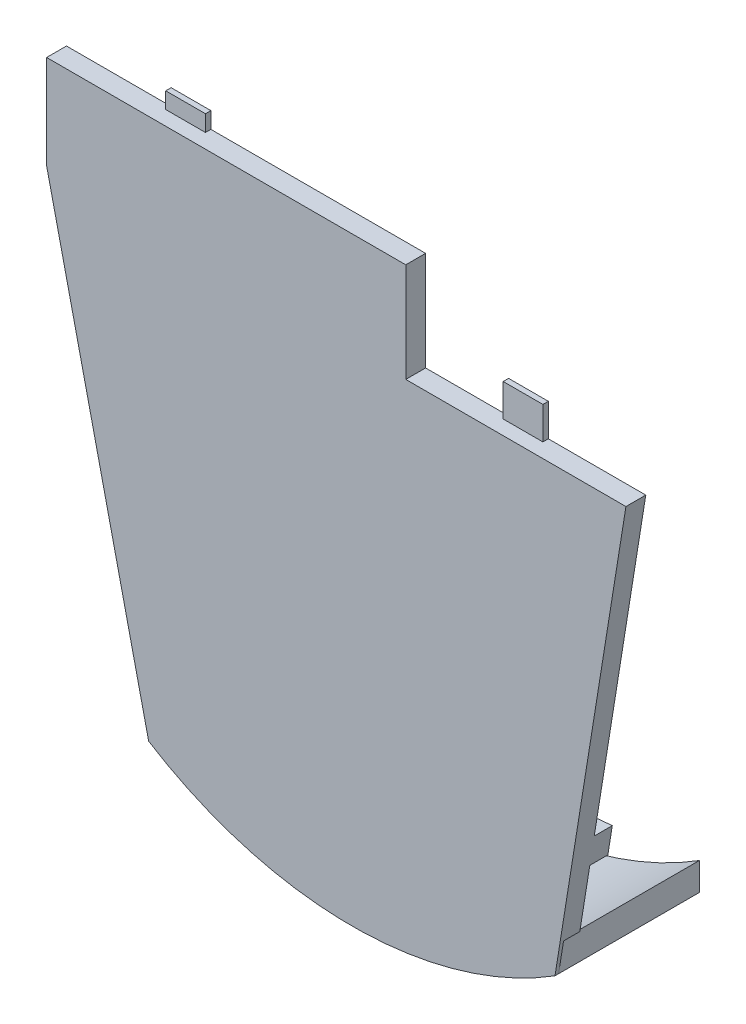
ISO-10303-21;
HEADER;
FILE_DESCRIPTION(('STEP AP214'),'2;1');
FILE_NAME('part.step','',(''),(''),'','','');
FILE_SCHEMA(('AUTOMOTIVE_DESIGN { 1 0 10303 214 1 1 1 1 }'));
ENDSEC;
DATA;
#1=APPLICATION_CONTEXT('core data for automotive mechanical design processes');
#2=APPLICATION_PROTOCOL_DEFINITION('international standard','automotive_design',2000,#1);
#3=PRODUCT_CONTEXT('',#1,'mechanical');
#4=PRODUCT('Part','Part','',(#3));
#5=PRODUCT_RELATED_PRODUCT_CATEGORY('part','',(#4));
#6=PRODUCT_DEFINITION_FORMATION('','',#4);
#7=PRODUCT_DEFINITION_CONTEXT('part definition',#1,'design');
#8=PRODUCT_DEFINITION('design','',#6,#7);
#9=PRODUCT_DEFINITION_SHAPE('','',#8);
#10=(LENGTH_UNIT() NAMED_UNIT(*) SI_UNIT(.MILLI.,.METRE.));
#11=(NAMED_UNIT(*) PLANE_ANGLE_UNIT() SI_UNIT($,.RADIAN.));
#12=(NAMED_UNIT(*) SI_UNIT($,.STERADIAN.) SOLID_ANGLE_UNIT());
#13=UNCERTAINTY_MEASURE_WITH_UNIT(LENGTH_MEASURE(1.E-05),#10,'distance_accuracy_value','');
#14=(GEOMETRIC_REPRESENTATION_CONTEXT(3) GLOBAL_UNCERTAINTY_ASSIGNED_CONTEXT((#13)) GLOBAL_UNIT_ASSIGNED_CONTEXT((#10,
#11,#12)) REPRESENTATION_CONTEXT('',''));
#15=CARTESIAN_POINT('',(0.,0.,0.));
#16=DIRECTION('',(0.,0.,1.));
#17=DIRECTION('',(1.,0.,0.));
#18=AXIS2_PLACEMENT_3D('',#15,#16,#17);
#19=CARTESIAN_POINT('',(-9.44819018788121,51.9759444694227,17.526));
#20=DIRECTION('',(0.,0.,-1.));
#21=DIRECTION('',(-1.,0.,0.));
#22=AXIS2_PLACEMENT_3D('',#19,#20,#21);
#23=PLANE('',#22);
#24=DIRECTION('',(0.167445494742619,0.985881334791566,0.));
#25=VECTOR('',#24,1.);
#26=CARTESIAN_POINT('',(19.4949588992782,19.3151711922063,17.526));
#27=LINE('',#26,#25);
#28=CARTESIAN_POINT('',(18.9420538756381,16.0597910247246,17.526));
#29=VERTEX_POINT('',#28);
#30=CARTESIAN_POINT('',(19.4949588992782,19.3151711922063,17.526));
#31=VERTEX_POINT('',#30);
#32=EDGE_CURVE('E797',#29,#31,#27,.T.);
#33=ORIENTED_EDGE('',*,*,#32,.F.);
#34=DIRECTION('',(-0.987358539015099,0.1585027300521,0.));
#35=VECTOR('',#34,1.);
#36=CARTESIAN_POINT('',(18.9420538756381,16.0597910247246,17.526));
#37=LINE('',#36,#35);
#38=CARTESIAN_POINT('',(21.3998245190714,15.6652399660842,17.526));
#39=VERTEX_POINT('',#38);
#40=EDGE_CURVE('E820',#39,#29,#37,.T.);
#41=ORIENTED_EDGE('',*,*,#40,.F.);
#42=DIRECTION('',(-0.158502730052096,-0.9873585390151,0.));
#43=VECTOR('',#42,1.);
#44=CARTESIAN_POINT('',(29.2772062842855,64.7356890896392,17.526));
#45=LINE('',#44,#43);
#46=CARTESIAN_POINT('',(19.9907352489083,6.88762255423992,17.526));
#47=VERTEX_POINT('',#46);
#48=EDGE_CURVE('E258',#39,#47,#45,.T.);
#49=ORIENTED_EDGE('',*,*,#48,.T.);
#50=DIRECTION('',(0.864845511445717,0.50203808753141,0.));
#51=VECTOR('',#50,1.);
#52=CARTESIAN_POINT('',(17.5483530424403,5.46983304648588,17.526));
#53=LINE('',#52,#51);
#54=CARTESIAN_POINT('',(19.2928023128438,6.48247630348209,17.526));
#55=VERTEX_POINT('',#54);
#56=EDGE_CURVE('E11',#55,#47,#53,.T.);
#57=ORIENTED_EDGE('',*,*,#56,.F.);
#58=DIRECTION('',(0.,1.,0.));
#59=VECTOR('',#58,1.);
#60=CARTESIAN_POINT('',(19.2928023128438,51.9759444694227,17.526));
#61=LINE('',#60,#59);
#62=CARTESIAN_POINT('',(19.2928023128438,6.43955842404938,17.526));
#63=VERTEX_POINT('',#62);
#64=EDGE_CURVE('E46',#63,#55,#61,.T.);
#65=ORIENTED_EDGE('',*,*,#64,.F.);
#66=CARTESIAN_POINT('',(-9.44819018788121,51.9759444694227,17.526));
#67=DIRECTION('',(0.,0.,-1.));
#68=DIRECTION('',(-1.,0.,0.));
#69=AXIS2_PLACEMENT_3D('',#66,#67,#68);
#70=CIRCLE('',#69,53.848);
#71=CARTESIAN_POINT('',(-37.8953693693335,6.25543374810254,17.526));
#72=VERTEX_POINT('',#71);
#73=EDGE_CURVE('E399',#63,#72,#70,.T.);
#74=ORIENTED_EDGE('',*,*,#73,.T.);
#75=DIRECTION('',(0.843246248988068,-0.537527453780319,0.));
#76=VECTOR('',#75,1.);
#77=CARTESIAN_POINT('',(-38.8871156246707,6.88762255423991,17.526));
#78=LINE('',#77,#76);
#79=CARTESIAN_POINT('',(-38.8871156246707,6.88762255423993,17.526));
#80=VERTEX_POINT('',#79);
#81=EDGE_CURVE('E41',#72,#80,#78,.F.);
#82=ORIENTED_EDGE('',*,*,#81,.T.);
#83=DIRECTION('',(-0.22239939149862,0.974955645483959,0.));
#84=VECTOR('',#83,1.);
#85=CARTESIAN_POINT('',(-52.2567937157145,65.4976890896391,17.526));
#86=LINE('',#85,#84);
#87=CARTESIAN_POINT('',(-40.7795120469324,15.183520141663,17.526));
#88=VERTEX_POINT('',#87);
#89=EDGE_CURVE('E406',#80,#88,#86,.T.);
#90=ORIENTED_EDGE('',*,*,#89,.T.);
#91=DIRECTION('',(0.958437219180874,0.285303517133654,0.));
#92=VECTOR('',#91,1.);
#93=CARTESIAN_POINT('',(-40.7795120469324,15.1835201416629,17.526));
#94=LINE('',#93,#92);
#95=CARTESIAN_POINT('',(-38.3414081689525,15.9092845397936,17.526));
#96=VERTEX_POINT('',#95);
#97=EDGE_CURVE('E259',#88,#96,#94,.T.);
#98=ORIENTED_EDGE('',*,*,#97,.T.);
#99=DIRECTION('',(-0.22239939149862,0.974955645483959,0.));
#100=VECTOR('',#99,1.);
#101=CARTESIAN_POINT('',(-38.3414081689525,15.9092845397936,17.526));
#102=LINE('',#101,#100);
#103=CARTESIAN_POINT('',(-39.1605051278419,19.5000461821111,17.526));
#104=VERTEX_POINT('',#103);
#105=EDGE_CURVE('E62',#96,#104,#102,.T.);
#106=ORIENTED_EDGE('',*,*,#105,.T.);
#107=DIRECTION('',(-0.982123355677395,-0.188238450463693,0.));
#108=VECTOR('',#107,1.);
#109=CARTESIAN_POINT('',(-39.1605051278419,19.5000461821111,17.526));
#110=LINE('',#109,#108);
#111=CARTESIAN_POINT('',(-41.6550984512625,19.0219205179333,17.526));
#112=VERTEX_POINT('',#111);
#113=EDGE_CURVE('E269',#104,#112,#110,.T.);
#114=ORIENTED_EDGE('',*,*,#113,.T.);
#115=CARTESIAN_POINT('',(-52.2567937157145,65.4976890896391,17.526));
#116=VERTEX_POINT('',#115);
#117=EDGE_CURVE('E402',#112,#116,#86,.T.);
#118=ORIENTED_EDGE('',*,*,#117,.T.);
#119=DIRECTION('',(0.,1.,0.));
#120=VECTOR('',#119,1.);
#121=CARTESIAN_POINT('',(-52.2567937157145,78.7056890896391,17.526));
#122=LINE('',#121,#120);
#123=CARTESIAN_POINT('',(-52.2567937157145,78.7056890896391,17.526));
#124=VERTEX_POINT('',#123);
#125=EDGE_CURVE('E403',#116,#124,#122,.T.);
#126=ORIENTED_EDGE('',*,*,#125,.T.);
#127=DIRECTION('',(1.,0.,0.));
#128=VECTOR('',#127,1.);
#129=CARTESIAN_POINT('',(-1.71079371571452,78.7056890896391,17.526));
#130=LINE('',#129,#128);
#131=CARTESIAN_POINT('',(-37.5247937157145,78.7056890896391,17.526));
#132=VERTEX_POINT('',#131);
#133=EDGE_CURVE('E407',#124,#132,#130,.T.);
#134=ORIENTED_EDGE('',*,*,#133,.T.);
#135=DIRECTION('',(0.,1.,0.));
#136=VECTOR('',#135,1.);
#137=CARTESIAN_POINT('',(-37.5247937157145,78.7056890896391,17.526));
#138=LINE('',#137,#136);
#139=CARTESIAN_POINT('',(-37.5247937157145,80.9916890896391,17.526));
#140=VERTEX_POINT('',#139);
#141=EDGE_CURVE('E382',#132,#140,#138,.T.);
#142=ORIENTED_EDGE('',*,*,#141,.T.);
#143=DIRECTION('',(1.,0.,0.));
#144=VECTOR('',#143,1.);
#145=CARTESIAN_POINT('',(-31.9367937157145,80.9916890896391,17.526));
#146=LINE('',#145,#144);
#147=CARTESIAN_POINT('',(-31.9367937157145,80.9916890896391,17.526));
#148=VERTEX_POINT('',#147);
#149=EDGE_CURVE('E370',#140,#148,#146,.T.);
#150=ORIENTED_EDGE('',*,*,#149,.T.);
#151=DIRECTION('',(0.,-1.,0.));
#152=VECTOR('',#151,1.);
#153=CARTESIAN_POINT('',(-31.9367937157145,78.7056890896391,17.526));
#154=LINE('',#153,#152);
#155=CARTESIAN_POINT('',(-31.9367937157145,78.7056890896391,17.526));
#156=VERTEX_POINT('',#155);
#157=EDGE_CURVE('E358',#148,#156,#154,.T.);
#158=ORIENTED_EDGE('',*,*,#157,.T.);
#159=CARTESIAN_POINT('',(-1.71079371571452,78.7056890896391,17.526));
#160=VERTEX_POINT('',#159);
#161=EDGE_CURVE('E405',#156,#160,#130,.T.);
#162=ORIENTED_EDGE('',*,*,#161,.T.);
#163=DIRECTION('',(0.,-1.,0.));
#164=VECTOR('',#163,1.);
#165=CARTESIAN_POINT('',(-1.71079371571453,64.7356890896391,17.526));
#166=LINE('',#165,#164);
#167=CARTESIAN_POINT('',(-1.71079371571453,64.7356890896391,17.526));
#168=VERTEX_POINT('',#167);
#169=EDGE_CURVE('E410',#160,#168,#166,.T.);
#170=ORIENTED_EDGE('',*,*,#169,.T.);
#171=DIRECTION('',(1.,0.,0.));
#172=VECTOR('',#171,1.);
#173=CARTESIAN_POINT('',(29.2772062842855,64.7356890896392,17.526));
#174=LINE('',#173,#172);
#175=CARTESIAN_POINT('',(9.97320628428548,64.7356890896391,17.526));
#176=VERTEX_POINT('',#175);
#177=EDGE_CURVE('E413',#168,#176,#174,.T.);
#178=ORIENTED_EDGE('',*,*,#177,.T.);
#179=DIRECTION('',(0.,1.,0.));
#180=VECTOR('',#179,1.);
#181=CARTESIAN_POINT('',(9.97320628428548,64.7356890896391,17.526));
#182=LINE('',#181,#180);
#183=CARTESIAN_POINT('',(9.97320628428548,69.3076890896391,17.526));
#184=VERTEX_POINT('',#183);
#185=EDGE_CURVE('E351',#176,#184,#182,.T.);
#186=ORIENTED_EDGE('',*,*,#185,.T.);
#187=DIRECTION('',(1.,0.,0.));
#188=VECTOR('',#187,1.);
#189=CARTESIAN_POINT('',(15.5612062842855,69.3076890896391,17.526));
#190=LINE('',#189,#188);
#191=CARTESIAN_POINT('',(15.5612062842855,69.3076890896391,17.526));
#192=VERTEX_POINT('',#191);
#193=EDGE_CURVE('E339',#184,#192,#190,.T.);
#194=ORIENTED_EDGE('',*,*,#193,.T.);
#195=DIRECTION('',(0.,-1.,0.));
#196=VECTOR('',#195,1.);
#197=CARTESIAN_POINT('',(15.5612062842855,64.7356890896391,17.526));
#198=LINE('',#197,#196);
#199=CARTESIAN_POINT('',(15.5612062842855,64.7356890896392,17.526));
#200=VERTEX_POINT('',#199);
#201=EDGE_CURVE('E349',#192,#200,#198,.T.);
#202=ORIENTED_EDGE('',*,*,#201,.T.);
#203=CARTESIAN_POINT('',(29.2772062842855,64.7356890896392,17.526));
#204=VERTEX_POINT('',#203);
#205=EDGE_CURVE('E412',#200,#204,#174,.T.);
#206=ORIENTED_EDGE('',*,*,#205,.T.);
#207=CARTESIAN_POINT('',(22.0238497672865,19.5524705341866,17.526));
#208=VERTEX_POINT('',#207);
#209=EDGE_CURVE('E396',#204,#208,#45,.T.);
#210=ORIENTED_EDGE('',*,*,#209,.T.);
#211=DIRECTION('',(0.995626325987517,0.0934249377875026,0.));
#212=VECTOR('',#211,1.);
#213=CARTESIAN_POINT('',(22.0238497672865,19.5524705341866,17.526));
#214=LINE('',#213,#212);
#215=EDGE_CURVE('E252',#31,#208,#214,.T.);
#216=ORIENTED_EDGE('',*,*,#215,.F.);
#217=EDGE_LOOP('',(#33,#41,#49,#57,#65,#74,#82,#90,#98,#106,#114,#118,#126,#134,#142,#150,#158,
#162,#170,#178,#186,#194,#202,#206,#210,#216));
#218=FACE_BOUND('',#217,.T.);
#219=ADVANCED_FACE('F37',(#218),#23,.T.);
#220=CARTESIAN_POINT('',(-52.2567937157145,78.7056890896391,20.32));
#221=DIRECTION('',(0.,-1.,0.));
#222=DIRECTION('',(1.,0.,0.));
#223=AXIS2_PLACEMENT_3D('',#220,#221,#222);
#224=PLANE('',#223);
#225=DIRECTION('',(0.,0.,-1.));
#226=VECTOR('',#225,1.);
#227=CARTESIAN_POINT('',(-31.9367937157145,78.7056890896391,18.288));
#228=LINE('',#227,#226);
#229=CARTESIAN_POINT('',(-31.9367937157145,78.7056890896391,18.288));
#230=VERTEX_POINT('',#229);
#231=EDGE_CURVE('E379',#230,#156,#228,.T.);
#232=ORIENTED_EDGE('',*,*,#231,.F.);
#233=DIRECTION('',(-1.,0.,0.));
#234=VECTOR('',#233,1.);
#235=CARTESIAN_POINT('',(-31.9367937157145,78.7056890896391,18.288));
#236=LINE('',#235,#234);
#237=CARTESIAN_POINT('',(-37.5247937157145,78.7056890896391,18.288));
#238=VERTEX_POINT('',#237);
#239=EDGE_CURVE('E369',#230,#238,#236,.T.);
#240=ORIENTED_EDGE('',*,*,#239,.T.);
#241=DIRECTION('',(0.,0.,-1.));
#242=VECTOR('',#241,1.);
#243=CARTESIAN_POINT('',(-37.5247937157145,78.7056890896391,18.288));
#244=LINE('',#243,#242);
#245=EDGE_CURVE('E392',#238,#132,#244,.T.);
#246=ORIENTED_EDGE('',*,*,#245,.T.);
#247=ORIENTED_EDGE('',*,*,#133,.F.);
#248=DIRECTION('',(0.,0.,-1.));
#249=VECTOR('',#248,1.);
#250=CARTESIAN_POINT('',(-52.2567937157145,78.7056890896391,20.32));
#251=LINE('',#250,#249);
#252=CARTESIAN_POINT('',(-52.2567937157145,78.7056890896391,20.32));
#253=VERTEX_POINT('',#252);
#254=EDGE_CURVE('E437',#253,#124,#251,.T.);
#255=ORIENTED_EDGE('',*,*,#254,.F.);
#256=DIRECTION('',(-1.,0.,0.));
#257=VECTOR('',#256,1.);
#258=CARTESIAN_POINT('',(-52.2567937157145,78.7056890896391,20.32));
#259=LINE('',#258,#257);
#260=CARTESIAN_POINT('',(-1.71079371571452,78.7056890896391,20.32));
#261=VERTEX_POINT('',#260);
#262=EDGE_CURVE('E452',#261,#253,#259,.T.);
#263=ORIENTED_EDGE('',*,*,#262,.F.);
#264=DIRECTION('',(0.,0.,-1.));
#265=VECTOR('',#264,1.);
#266=CARTESIAN_POINT('',(-1.71079371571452,78.7056890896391,20.32));
#267=LINE('',#266,#265);
#268=EDGE_CURVE('E434',#261,#160,#267,.T.);
#269=ORIENTED_EDGE('',*,*,#268,.T.);
#270=ORIENTED_EDGE('',*,*,#161,.F.);
#271=EDGE_LOOP('',(#232,#240,#246,#247,#255,#263,#269,#270));
#272=FACE_BOUND('',#271,.T.);
#273=ADVANCED_FACE('F485',(#272),#224,.F.);
#274=CARTESIAN_POINT('',(-1.71079371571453,64.7356890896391,20.32));
#275=DIRECTION('',(0.,-1.,0.));
#276=DIRECTION('',(1.,0.,0.));
#277=AXIS2_PLACEMENT_3D('',#274,#275,#276);
#278=PLANE('',#277);
#279=ORIENTED_EDGE('',*,*,#205,.F.);
#280=DIRECTION('',(0.,0.,-1.));
#281=VECTOR('',#280,1.);
#282=CARTESIAN_POINT('',(15.5612062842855,64.7356890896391,18.288));
#283=LINE('',#282,#281);
#284=CARTESIAN_POINT('',(15.5612062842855,64.7356890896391,18.288));
#285=VERTEX_POINT('',#284);
#286=EDGE_CURVE('E348',#285,#200,#283,.T.);
#287=ORIENTED_EDGE('',*,*,#286,.F.);
#288=DIRECTION('',(-1.,0.,0.));
#289=VECTOR('',#288,1.);
#290=CARTESIAN_POINT('',(15.5612062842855,64.7356890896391,18.288));
#291=LINE('',#290,#289);
#292=CARTESIAN_POINT('',(9.97320628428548,64.7356890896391,18.288));
#293=VERTEX_POINT('',#292);
#294=EDGE_CURVE('E338',#285,#293,#291,.T.);
#295=ORIENTED_EDGE('',*,*,#294,.T.);
#296=DIRECTION('',(0.,0.,-1.));
#297=VECTOR('',#296,1.);
#298=CARTESIAN_POINT('',(9.97320628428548,64.7356890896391,18.288));
#299=LINE('',#298,#297);
#300=EDGE_CURVE('E361',#293,#176,#299,.T.);
#301=ORIENTED_EDGE('',*,*,#300,.T.);
#302=ORIENTED_EDGE('',*,*,#177,.F.);
#303=DIRECTION('',(0.,0.,-1.));
#304=VECTOR('',#303,1.);
#305=CARTESIAN_POINT('',(-1.71079371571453,64.7356890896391,20.32));
#306=LINE('',#305,#304);
#307=CARTESIAN_POINT('',(-1.71079371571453,64.7356890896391,20.32));
#308=VERTEX_POINT('',#307);
#309=EDGE_CURVE('E431',#308,#168,#306,.T.);
#310=ORIENTED_EDGE('',*,*,#309,.F.);
#311=DIRECTION('',(-1.,0.,0.));
#312=VECTOR('',#311,1.);
#313=CARTESIAN_POINT('',(-1.71079371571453,64.7356890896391,20.32));
#314=LINE('',#313,#312);
#315=CARTESIAN_POINT('',(29.2772062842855,64.7356890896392,20.32));
#316=VERTEX_POINT('',#315);
#317=EDGE_CURVE('E456',#316,#308,#314,.T.);
#318=ORIENTED_EDGE('',*,*,#317,.F.);
#319=DIRECTION('',(0.,0.,-1.));
#320=VECTOR('',#319,1.);
#321=CARTESIAN_POINT('',(29.2772062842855,64.7356890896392,20.32));
#322=LINE('',#321,#320);
#323=EDGE_CURVE('E428',#316,#204,#322,.T.);
#324=ORIENTED_EDGE('',*,*,#323,.T.);
#325=EDGE_LOOP('',(#279,#287,#295,#301,#302,#310,#318,#324));
#326=FACE_BOUND('',#325,.T.);
#327=ADVANCED_FACE('F473',(#326),#278,.F.);
#328=CARTESIAN_POINT('',(-1.71079371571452,78.7056890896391,20.32));
#329=DIRECTION('',(-1.,0.,0.));
#330=DIRECTION('',(0.,-1.,0.));
#331=AXIS2_PLACEMENT_3D('',#328,#329,#330);
#332=PLANE('',#331);
#333=ORIENTED_EDGE('',*,*,#169,.F.);
#334=ORIENTED_EDGE('',*,*,#268,.F.);
#335=DIRECTION('',(0.,1.,0.));
#336=VECTOR('',#335,1.);
#337=CARTESIAN_POINT('',(-1.71079371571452,78.7056890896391,20.32));
#338=LINE('',#337,#336);
#339=EDGE_CURVE('E454',#308,#261,#338,.T.);
#340=ORIENTED_EDGE('',*,*,#339,.F.);
#341=ORIENTED_EDGE('',*,*,#309,.T.);
#342=EDGE_LOOP('',(#333,#334,#340,#341));
#343=FACE_BOUND('',#342,.T.);
#344=ADVANCED_FACE('F481',(#343),#332,.F.);
#345=CARTESIAN_POINT('',(-52.2567937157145,65.4976890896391,20.32));
#346=DIRECTION('',(1.,0.,0.));
#347=DIRECTION('',(0.,1.,0.));
#348=AXIS2_PLACEMENT_3D('',#345,#346,#347);
#349=PLANE('',#348);
#350=ORIENTED_EDGE('',*,*,#125,.F.);
#351=DIRECTION('',(0.,0.,-1.));
#352=VECTOR('',#351,1.);
#353=CARTESIAN_POINT('',(-52.2567937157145,65.4976890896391,20.32));
#354=LINE('',#353,#352);
#355=CARTESIAN_POINT('',(-52.2567937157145,65.4976890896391,20.32));
#356=VERTEX_POINT('',#355);
#357=EDGE_CURVE('E440',#356,#116,#354,.T.);
#358=ORIENTED_EDGE('',*,*,#357,.F.);
#359=DIRECTION('',(0.,-1.,0.));
#360=VECTOR('',#359,1.);
#361=CARTESIAN_POINT('',(-52.2567937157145,65.4976890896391,20.32));
#362=LINE('',#361,#360);
#363=EDGE_CURVE('E450',#253,#356,#362,.T.);
#364=ORIENTED_EDGE('',*,*,#363,.F.);
#365=ORIENTED_EDGE('',*,*,#254,.T.);
#366=EDGE_LOOP('',(#350,#358,#364,#365));
#367=FACE_BOUND('',#366,.T.);
#368=ADVANCED_FACE('F491',(#367),#349,.F.);
#369=CARTESIAN_POINT('',(-9.3012835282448,48.1687777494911,20.32));
#370=DIRECTION('',(0.,0.,-1.));
#371=DIRECTION('',(-1.,0.,0.));
#372=AXIS2_PLACEMENT_3D('',#369,#370,#371);
#373=CYLINDRICAL_SURFACE('',#372,53.848);
#374=CARTESIAN_POINT('',(-9.3012835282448,48.1687777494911,0.));
#375=DIRECTION('',(0.,0.,1.));
#376=DIRECTION('',(1.,0.,0.));
#377=AXIS2_PLACEMENT_3D('',#374,#375,#376);
#378=CIRCLE('',#377,53.848);
#379=CARTESIAN_POINT('',(-37.8953693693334,2.54,0.));
#380=VERTEX_POINT('',#379);
#381=CARTESIAN_POINT('',(19.2928023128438,2.54,0.));
#382=VERTEX_POINT('',#381);
#383=EDGE_CURVE('E416',#380,#382,#378,.T.);
#384=ORIENTED_EDGE('',*,*,#383,.T.);
#385=DIRECTION('',(0.,0.,-1.));
#386=VECTOR('',#385,1.);
#387=CARTESIAN_POINT('',(19.2928023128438,2.54,19.812));
#388=LINE('',#387,#386);
#389=CARTESIAN_POINT('',(19.2928023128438,2.54,19.812));
#390=VERTEX_POINT('',#389);
#391=EDGE_CURVE('E302',#390,#382,#388,.T.);
#392=ORIENTED_EDGE('',*,*,#391,.F.);
#393=DIRECTION('',(0.,0.,-1.));
#394=VECTOR('',#393,1.);
#395=CARTESIAN_POINT('',(19.2928023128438,2.54,20.32));
#396=LINE('',#395,#394);
#397=CARTESIAN_POINT('',(19.2928023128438,2.54,20.32));
#398=VERTEX_POINT('',#397);
#399=EDGE_CURVE('E425',#398,#390,#396,.T.);
#400=ORIENTED_EDGE('',*,*,#399,.F.);
#401=CARTESIAN_POINT('',(-9.3012835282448,48.1687777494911,20.32));
#402=DIRECTION('',(0.,0.,1.));
#403=DIRECTION('',(1.,0.,0.));
#404=AXIS2_PLACEMENT_3D('',#401,#402,#403);
#405=CIRCLE('',#404,53.848);
#406=CARTESIAN_POINT('',(-37.8953693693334,2.54,20.32));
#407=VERTEX_POINT('',#406);
#408=EDGE_CURVE('E419',#407,#398,#405,.T.);
#409=ORIENTED_EDGE('',*,*,#408,.F.);
#410=DIRECTION('',(0.,0.,-1.));
#411=VECTOR('',#410,1.);
#412=CARTESIAN_POINT('',(-37.8953693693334,2.54,20.32));
#413=LINE('',#412,#411);
#414=CARTESIAN_POINT('',(-37.8953693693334,2.54,19.812));
#415=VERTEX_POINT('',#414);
#416=EDGE_CURVE('E443',#407,#415,#413,.T.);
#417=ORIENTED_EDGE('',*,*,#416,.T.);
#418=DIRECTION('',(0.,0.,-1.));
#419=VECTOR('',#418,1.);
#420=CARTESIAN_POINT('',(-37.8953693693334,2.54,19.812));
#421=LINE('',#420,#419);
#422=EDGE_CURVE('E304',#415,#380,#421,.T.);
#423=ORIENTED_EDGE('',*,*,#422,.T.);
#424=EDGE_LOOP('',(#384,#392,#400,#409,#417,#423));
#425=FACE_BOUND('',#424,.T.);
#426=ADVANCED_FACE('F39',(#425),#373,.T.);
#427=CARTESIAN_POINT('',(29.2772062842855,64.7356890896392,20.32));
#428=DIRECTION('',(-0.9873585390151,0.158502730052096,0.));
#429=DIRECTION('',(-0.158502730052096,-0.9873585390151,0.));
#430=AXIS2_PLACEMENT_3D('',#427,#428,#429);
#431=PLANE('',#430);
#432=DIRECTION('',(-0.158502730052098,-0.9873585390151,0.));
#433=VECTOR('',#432,1.);
#434=CARTESIAN_POINT('',(19.9907352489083,6.88762255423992,19.812));
#435=LINE('',#434,#433);
#436=CARTESIAN_POINT('',(19.9907352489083,6.88762255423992,19.812));
#437=VERTEX_POINT('',#436);
#438=EDGE_CURVE('E292',#437,#390,#435,.T.);
#439=ORIENTED_EDGE('',*,*,#438,.F.);
#440=DIRECTION('',(0.,0.,-1.));
#441=VECTOR('',#440,1.);
#442=CARTESIAN_POINT('',(19.9907352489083,6.88762255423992,19.812));
#443=LINE('',#442,#441);
#444=EDGE_CURVE('E305',#437,#47,#443,.T.);
#445=ORIENTED_EDGE('',*,*,#444,.T.);
#446=ORIENTED_EDGE('',*,*,#48,.F.);
#447=DIRECTION('',(0.,0.,1.));
#448=VECTOR('',#447,1.);
#449=CARTESIAN_POINT('',(21.3998245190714,15.6652399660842,14.986));
#450=LINE('',#449,#448);
#451=CARTESIAN_POINT('',(21.3998245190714,15.6652399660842,14.986));
#452=VERTEX_POINT('',#451);
#453=EDGE_CURVE('E237',#452,#39,#450,.T.);
#454=ORIENTED_EDGE('',*,*,#453,.F.);
#455=DIRECTION('',(-0.158502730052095,-0.9873585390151,0.));
#456=VECTOR('',#455,1.);
#457=CARTESIAN_POINT('',(21.3998245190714,15.6652399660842,14.986));
#458=LINE('',#457,#456);
#459=CARTESIAN_POINT('',(22.0238497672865,19.5524705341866,14.986));
#460=VERTEX_POINT('',#459);
#461=EDGE_CURVE('E244',#460,#452,#458,.T.);
#462=ORIENTED_EDGE('',*,*,#461,.F.);
#463=DIRECTION('',(0.,0.,1.));
#464=VECTOR('',#463,1.);
#465=CARTESIAN_POINT('',(22.0238497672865,19.5524705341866,14.986));
#466=LINE('',#465,#464);
#467=EDGE_CURVE('E796',#460,#208,#466,.T.);
#468=ORIENTED_EDGE('',*,*,#467,.T.);
#469=ORIENTED_EDGE('',*,*,#209,.F.);
#470=ORIENTED_EDGE('',*,*,#323,.F.);
#471=DIRECTION('',(0.158502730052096,0.9873585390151,0.));
#472=VECTOR('',#471,1.);
#473=CARTESIAN_POINT('',(29.2772062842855,64.7356890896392,20.32));
#474=LINE('',#473,#472);
#475=EDGE_CURVE('E457',#398,#316,#474,.T.);
#476=ORIENTED_EDGE('',*,*,#475,.F.);
#477=ORIENTED_EDGE('',*,*,#399,.T.);
#478=EDGE_LOOP('',(#439,#445,#446,#454,#462,#468,#469,#470,#476,#477));
#479=FACE_BOUND('',#478,.T.);
#480=ADVANCED_FACE('F256',(#479),#431,.F.);
#481=CARTESIAN_POINT('',(-37.8953693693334,2.54,20.32));
#482=DIRECTION('',(0.974955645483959,0.22239939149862,0.));
#483=DIRECTION('',(-0.22239939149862,0.974955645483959,0.));
#484=AXIS2_PLACEMENT_3D('',#481,#482,#483);
#485=PLANE('',#484);
#486=ORIENTED_EDGE('',*,*,#89,.F.);
#487=DIRECTION('',(0.,0.,-1.));
#488=VECTOR('',#487,1.);
#489=CARTESIAN_POINT('',(-38.8871156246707,6.88762255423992,19.812));
#490=LINE('',#489,#488);
#491=CARTESIAN_POINT('',(-38.8871156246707,6.88762255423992,19.812));
#492=VERTEX_POINT('',#491);
#493=EDGE_CURVE('E321',#492,#80,#490,.T.);
#494=ORIENTED_EDGE('',*,*,#493,.F.);
#495=DIRECTION('',(-0.222399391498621,0.974955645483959,0.));
#496=VECTOR('',#495,1.);
#497=CARTESIAN_POINT('',(-38.8871156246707,6.88762255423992,19.812));
#498=LINE('',#497,#496);
#499=EDGE_CURVE('E312',#415,#492,#498,.T.);
#500=ORIENTED_EDGE('',*,*,#499,.F.);
#501=ORIENTED_EDGE('',*,*,#416,.F.);
#502=DIRECTION('',(0.22239939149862,-0.974955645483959,0.));
#503=VECTOR('',#502,1.);
#504=CARTESIAN_POINT('',(-37.8953693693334,2.54,20.32));
#505=LINE('',#504,#503);
#506=EDGE_CURVE('E446',#356,#407,#505,.T.);
#507=ORIENTED_EDGE('',*,*,#506,.F.);
#508=ORIENTED_EDGE('',*,*,#357,.T.);
#509=ORIENTED_EDGE('',*,*,#117,.F.);
#510=DIRECTION('',(0.,0.,1.));
#511=VECTOR('',#510,1.);
#512=CARTESIAN_POINT('',(-41.6550984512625,19.0219205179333,14.986));
#513=LINE('',#512,#511);
#514=CARTESIAN_POINT('',(-41.6550984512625,19.0219205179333,14.986));
#515=VERTEX_POINT('',#514);
#516=EDGE_CURVE('E285',#515,#112,#513,.T.);
#517=ORIENTED_EDGE('',*,*,#516,.F.);
#518=DIRECTION('',(0.22239939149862,-0.974955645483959,0.));
#519=VECTOR('',#518,1.);
#520=CARTESIAN_POINT('',(-41.6550984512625,19.0219205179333,14.986));
#521=LINE('',#520,#519);
#522=CARTESIAN_POINT('',(-40.7795120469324,15.1835201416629,14.986));
#523=VERTEX_POINT('',#522);
#524=EDGE_CURVE('E275',#515,#523,#521,.T.);
#525=ORIENTED_EDGE('',*,*,#524,.T.);
#526=DIRECTION('',(0.,0.,1.));
#527=VECTOR('',#526,1.);
#528=CARTESIAN_POINT('',(-40.7795120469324,15.1835201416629,14.986));
#529=LINE('',#528,#527);
#530=EDGE_CURVE('E281',#523,#88,#529,.T.);
#531=ORIENTED_EDGE('',*,*,#530,.T.);
#532=EDGE_LOOP('',(#486,#494,#500,#501,#507,#508,#509,#517,#525,#531));
#533=FACE_BOUND('',#532,.T.);
#534=ADVANCED_FACE('F495',(#533),#485,.F.);
#535=CARTESIAN_POINT('',(-9.3012835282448,48.1687777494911,20.32));
#536=DIRECTION('',(0.,0.,1.));
#537=DIRECTION('',(1.,0.,0.));
#538=AXIS2_PLACEMENT_3D('',#535,#536,#537);
#539=PLANE('',#538);
#540=ORIENTED_EDGE('',*,*,#408,.T.);
#541=ORIENTED_EDGE('',*,*,#475,.T.);
#542=ORIENTED_EDGE('',*,*,#317,.T.);
#543=ORIENTED_EDGE('',*,*,#339,.T.);
#544=ORIENTED_EDGE('',*,*,#262,.T.);
#545=ORIENTED_EDGE('',*,*,#363,.T.);
#546=ORIENTED_EDGE('',*,*,#506,.T.);
#547=EDGE_LOOP('',(#540,#541,#542,#543,#544,#545,#546));
#548=FACE_BOUND('',#547,.T.);
#549=ADVANCED_FACE('F463',(#548),#539,.T.);
#550=CARTESIAN_POINT('',(-9.3012835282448,48.1687777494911,0.));
#551=DIRECTION('',(0.,0.,1.));
#552=DIRECTION('',(1.,0.,0.));
#553=AXIS2_PLACEMENT_3D('',#550,#551,#552);
#554=PLANE('',#553);
#555=CARTESIAN_POINT('',(-9.44819018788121,51.9759444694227,0.));
#556=DIRECTION('',(0.,0.,-1.));
#557=DIRECTION('',(-1.,0.,0.));
#558=AXIS2_PLACEMENT_3D('',#555,#556,#557);
#559=CIRCLE('',#558,53.848);
#560=CARTESIAN_POINT('',(19.2928023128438,6.43955842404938,0.));
#561=VERTEX_POINT('',#560);
#562=CARTESIAN_POINT('',(-37.8953693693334,6.25543374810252,0.));
#563=VERTEX_POINT('',#562);
#564=EDGE_CURVE('E389',#561,#563,#559,.T.);
#565=ORIENTED_EDGE('',*,*,#564,.F.);
#566=DIRECTION('',(0.,1.,0.));
#567=VECTOR('',#566,1.);
#568=CARTESIAN_POINT('',(19.2928023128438,2.54,0.));
#569=LINE('',#568,#567);
#570=EDGE_CURVE('E296',#382,#561,#569,.T.);
#571=ORIENTED_EDGE('',*,*,#570,.F.);
#572=ORIENTED_EDGE('',*,*,#383,.F.);
#573=DIRECTION('',(0.,-1.,0.));
#574=VECTOR('',#573,1.);
#575=CARTESIAN_POINT('',(-37.8953693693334,2.54,0.));
#576=LINE('',#575,#574);
#577=EDGE_CURVE('E284',#563,#380,#576,.T.);
#578=ORIENTED_EDGE('',*,*,#577,.F.);
#579=EDGE_LOOP('',(#565,#571,#572,#578));
#580=FACE_BOUND('',#579,.T.);
#581=ADVANCED_FACE('F505',(#580),#554,.F.);
#582=CARTESIAN_POINT('',(-9.44819018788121,51.9759444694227,17.526));
#583=DIRECTION('',(0.,0.,-1.));
#584=DIRECTION('',(-1.,0.,0.));
#585=AXIS2_PLACEMENT_3D('',#582,#583,#584);
#586=CYLINDRICAL_SURFACE('',#585,53.848);
#587=ORIENTED_EDGE('',*,*,#73,.F.);
#588=DIRECTION('',(0.,0.,-1.));
#589=VECTOR('',#588,1.);
#590=CARTESIAN_POINT('',(19.2928023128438,6.43955842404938,17.526));
#591=LINE('',#590,#589);
#592=EDGE_CURVE('E307',#63,#561,#591,.T.);
#593=ORIENTED_EDGE('',*,*,#592,.T.);
#594=ORIENTED_EDGE('',*,*,#564,.T.);
#595=DIRECTION('',(0.,0.,-1.));
#596=VECTOR('',#595,1.);
#597=CARTESIAN_POINT('',(-37.8953693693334,6.25543374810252,19.812));
#598=LINE('',#597,#596);
#599=EDGE_CURVE('E328',#72,#563,#598,.T.);
#600=ORIENTED_EDGE('',*,*,#599,.F.);
#601=EDGE_LOOP('',(#587,#593,#594,#600));
#602=FACE_BOUND('',#601,.T.);
#603=ADVANCED_FACE('F512',(#602),#586,.F.);
#604=CARTESIAN_POINT('',(-31.9367937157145,78.7056890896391,18.288));
#605=DIRECTION('',(1.,0.,0.));
#606=DIRECTION('',(0.,0.,-1.));
#607=AXIS2_PLACEMENT_3D('',#604,#605,#606);
#608=PLANE('',#607);
#609=ORIENTED_EDGE('',*,*,#157,.F.);
#610=DIRECTION('',(0.,0.,-1.));
#611=VECTOR('',#610,1.);
#612=CARTESIAN_POINT('',(-31.9367937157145,80.9916890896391,18.288));
#613=LINE('',#612,#611);
#614=CARTESIAN_POINT('',(-31.9367937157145,80.9916890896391,18.288));
#615=VERTEX_POINT('',#614);
#616=EDGE_CURVE('E387',#615,#148,#613,.T.);
#617=ORIENTED_EDGE('',*,*,#616,.F.);
#618=DIRECTION('',(0.,-1.,0.));
#619=VECTOR('',#618,1.);
#620=CARTESIAN_POINT('',(-31.9367937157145,78.7056890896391,18.288));
#621=LINE('',#620,#619);
#622=EDGE_CURVE('E366',#615,#230,#621,.T.);
#623=ORIENTED_EDGE('',*,*,#622,.T.);
#624=ORIENTED_EDGE('',*,*,#231,.T.);
#625=EDGE_LOOP('',(#609,#617,#623,#624));
#626=FACE_BOUND('',#625,.T.);
#627=ADVANCED_FACE('F541',(#626),#608,.T.);
#628=CARTESIAN_POINT('',(-31.9367937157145,80.9916890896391,18.288));
#629=DIRECTION('',(0.,1.,0.));
#630=DIRECTION('',(-1.,0.,0.));
#631=AXIS2_PLACEMENT_3D('',#628,#629,#630);
#632=PLANE('',#631);
#633=ORIENTED_EDGE('',*,*,#149,.F.);
#634=DIRECTION('',(0.,0.,-1.));
#635=VECTOR('',#634,1.);
#636=CARTESIAN_POINT('',(-37.5247937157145,80.9916890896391,18.288));
#637=LINE('',#636,#635);
#638=CARTESIAN_POINT('',(-37.5247937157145,80.9916890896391,18.288));
#639=VERTEX_POINT('',#638);
#640=EDGE_CURVE('E390',#639,#140,#637,.T.);
#641=ORIENTED_EDGE('',*,*,#640,.F.);
#642=DIRECTION('',(1.,0.,0.));
#643=VECTOR('',#642,1.);
#644=CARTESIAN_POINT('',(-31.9367937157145,80.9916890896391,18.288));
#645=LINE('',#644,#643);
#646=EDGE_CURVE('E376',#639,#615,#645,.T.);
#647=ORIENTED_EDGE('',*,*,#646,.T.);
#648=ORIENTED_EDGE('',*,*,#616,.T.);
#649=EDGE_LOOP('',(#633,#641,#647,#648));
#650=FACE_BOUND('',#649,.T.);
#651=ADVANCED_FACE('F595',(#650),#632,.T.);
#652=CARTESIAN_POINT('',(-37.5247937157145,78.7056890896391,18.288));
#653=DIRECTION('',(-1.,0.,0.));
#654=DIRECTION('',(0.,0.,1.));
#655=AXIS2_PLACEMENT_3D('',#652,#653,#654);
#656=PLANE('',#655);
#657=ORIENTED_EDGE('',*,*,#141,.F.);
#658=ORIENTED_EDGE('',*,*,#245,.F.);
#659=DIRECTION('',(0.,1.,0.));
#660=VECTOR('',#659,1.);
#661=CARTESIAN_POINT('',(-37.5247937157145,78.7056890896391,18.288));
#662=LINE('',#661,#660);
#663=EDGE_CURVE('E373',#238,#639,#662,.T.);
#664=ORIENTED_EDGE('',*,*,#663,.T.);
#665=ORIENTED_EDGE('',*,*,#640,.T.);
#666=EDGE_LOOP('',(#657,#658,#664,#665));
#667=FACE_BOUND('',#666,.T.);
#668=ADVANCED_FACE('F603',(#667),#656,.T.);
#669=CARTESIAN_POINT('',(0.,0.,18.288));
#670=DIRECTION('',(0.,0.,1.));
#671=DIRECTION('',(1.,0.,0.));
#672=AXIS2_PLACEMENT_3D('',#669,#670,#671);
#673=PLANE('',#672);
#674=ORIENTED_EDGE('',*,*,#622,.F.);
#675=ORIENTED_EDGE('',*,*,#646,.F.);
#676=ORIENTED_EDGE('',*,*,#663,.F.);
#677=ORIENTED_EDGE('',*,*,#239,.F.);
#678=EDGE_LOOP('',(#674,#675,#676,#677));
#679=FACE_BOUND('',#678,.T.);
#680=ADVANCED_FACE('F612',(#679),#673,.T.);
#681=CARTESIAN_POINT('',(15.5612062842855,64.7356890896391,18.288));
#682=DIRECTION('',(1.,0.,0.));
#683=DIRECTION('',(0.,0.,-1.));
#684=AXIS2_PLACEMENT_3D('',#681,#682,#683);
#685=PLANE('',#684);
#686=ORIENTED_EDGE('',*,*,#201,.F.);
#687=DIRECTION('',(0.,0.,-1.));
#688=VECTOR('',#687,1.);
#689=CARTESIAN_POINT('',(15.5612062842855,69.3076890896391,18.288));
#690=LINE('',#689,#688);
#691=CARTESIAN_POINT('',(15.5612062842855,69.3076890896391,18.288));
#692=VERTEX_POINT('',#691);
#693=EDGE_CURVE('E356',#692,#192,#690,.T.);
#694=ORIENTED_EDGE('',*,*,#693,.F.);
#695=DIRECTION('',(0.,-1.,0.));
#696=VECTOR('',#695,1.);
#697=CARTESIAN_POINT('',(15.5612062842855,64.7356890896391,18.288));
#698=LINE('',#697,#696);
#699=EDGE_CURVE('E335',#692,#285,#698,.T.);
#700=ORIENTED_EDGE('',*,*,#699,.T.);
#701=ORIENTED_EDGE('',*,*,#286,.T.);
#702=EDGE_LOOP('',(#686,#694,#700,#701));
#703=FACE_BOUND('',#702,.T.);
#704=ADVANCED_FACE('F620',(#703),#685,.T.);
#705=CARTESIAN_POINT('',(15.5612062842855,69.3076890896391,18.288));
#706=DIRECTION('',(0.,1.,0.));
#707=DIRECTION('',(0.,0.,1.));
#708=AXIS2_PLACEMENT_3D('',#705,#706,#707);
#709=PLANE('',#708);
#710=ORIENTED_EDGE('',*,*,#193,.F.);
#711=DIRECTION('',(0.,0.,-1.));
#712=VECTOR('',#711,1.);
#713=CARTESIAN_POINT('',(9.97320628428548,69.3076890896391,18.288));
#714=LINE('',#713,#712);
#715=CARTESIAN_POINT('',(9.97320628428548,69.3076890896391,18.288));
#716=VERTEX_POINT('',#715);
#717=EDGE_CURVE('E359',#716,#184,#714,.T.);
#718=ORIENTED_EDGE('',*,*,#717,.F.);
#719=DIRECTION('',(1.,0.,0.));
#720=VECTOR('',#719,1.);
#721=CARTESIAN_POINT('',(15.5612062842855,69.3076890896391,18.288));
#722=LINE('',#721,#720);
#723=EDGE_CURVE('E345',#716,#692,#722,.T.);
#724=ORIENTED_EDGE('',*,*,#723,.T.);
#725=ORIENTED_EDGE('',*,*,#693,.T.);
#726=EDGE_LOOP('',(#710,#718,#724,#725));
#727=FACE_BOUND('',#726,.T.);
#728=ADVANCED_FACE('F629',(#727),#709,.T.);
#729=CARTESIAN_POINT('',(9.97320628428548,64.7356890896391,18.288));
#730=DIRECTION('',(-1.,0.,0.));
#731=DIRECTION('',(0.,0.,1.));
#732=AXIS2_PLACEMENT_3D('',#729,#730,#731);
#733=PLANE('',#732);
#734=ORIENTED_EDGE('',*,*,#185,.F.);
#735=ORIENTED_EDGE('',*,*,#300,.F.);
#736=DIRECTION('',(0.,1.,0.));
#737=VECTOR('',#736,1.);
#738=CARTESIAN_POINT('',(9.97320628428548,64.7356890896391,18.288));
#739=LINE('',#738,#737);
#740=EDGE_CURVE('E342',#293,#716,#739,.T.);
#741=ORIENTED_EDGE('',*,*,#740,.T.);
#742=ORIENTED_EDGE('',*,*,#717,.T.);
#743=EDGE_LOOP('',(#734,#735,#741,#742));
#744=FACE_BOUND('',#743,.T.);
#745=ADVANCED_FACE('F638',(#744),#733,.T.);
#746=CARTESIAN_POINT('',(0.,0.,18.288));
#747=DIRECTION('',(0.,0.,1.));
#748=DIRECTION('',(1.,0.,0.));
#749=AXIS2_PLACEMENT_3D('',#746,#747,#748);
#750=PLANE('',#749);
#751=ORIENTED_EDGE('',*,*,#699,.F.);
#752=ORIENTED_EDGE('',*,*,#723,.F.);
#753=ORIENTED_EDGE('',*,*,#740,.F.);
#754=ORIENTED_EDGE('',*,*,#294,.F.);
#755=EDGE_LOOP('',(#751,#752,#753,#754));
#756=FACE_BOUND('',#755,.T.);
#757=ADVANCED_FACE('F647',(#756),#750,.T.);
#758=CARTESIAN_POINT('',(-37.8953693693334,2.54,19.812));
#759=DIRECTION('',(1.,0.,0.));
#760=DIRECTION('',(0.,0.,-1.));
#761=AXIS2_PLACEMENT_3D('',#758,#759,#760);
#762=PLANE('',#761);
#763=ORIENTED_EDGE('',*,*,#577,.T.);
#764=ORIENTED_EDGE('',*,*,#422,.F.);
#765=DIRECTION('',(0.,-1.,0.));
#766=VECTOR('',#765,1.);
#767=CARTESIAN_POINT('',(-37.8953693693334,2.54,19.812));
#768=LINE('',#767,#766);
#769=CARTESIAN_POINT('',(-37.8953693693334,6.25543374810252,19.812));
#770=VERTEX_POINT('',#769);
#771=EDGE_CURVE('E318',#770,#415,#768,.T.);
#772=ORIENTED_EDGE('',*,*,#771,.F.);
#773=EDGE_CURVE('E324',#770,#72,#598,.T.);
#774=ORIENTED_EDGE('',*,*,#773,.T.);
#775=ORIENTED_EDGE('',*,*,#599,.T.);
#776=EDGE_LOOP('',(#763,#764,#772,#774,#775));
#777=FACE_BOUND('',#776,.T.);
#778=ADVANCED_FACE('F655',(#777),#762,.F.);
#779=CARTESIAN_POINT('',(-37.8953693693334,6.25543374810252,19.812));
#780=DIRECTION('',(0.537527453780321,0.843246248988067,0.));
#781=DIRECTION('',(-0.843246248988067,0.537527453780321,0.));
#782=AXIS2_PLACEMENT_3D('',#779,#780,#781);
#783=PLANE('',#782);
#784=ORIENTED_EDGE('',*,*,#81,.F.);
#785=ORIENTED_EDGE('',*,*,#773,.F.);
#786=DIRECTION('',(0.843246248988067,-0.537527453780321,0.));
#787=VECTOR('',#786,1.);
#788=CARTESIAN_POINT('',(-37.8953693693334,6.25543374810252,19.812));
#789=LINE('',#788,#787);
#790=EDGE_CURVE('E315',#492,#770,#789,.T.);
#791=ORIENTED_EDGE('',*,*,#790,.F.);
#792=ORIENTED_EDGE('',*,*,#493,.T.);
#793=EDGE_LOOP('',(#784,#785,#791,#792));
#794=FACE_BOUND('',#793,.T.);
#795=ADVANCED_FACE('F664',(#794),#783,.F.);
#796=CARTESIAN_POINT('',(0.,0.,19.812));
#797=DIRECTION('',(0.,0.,-1.));
#798=DIRECTION('',(-1.,0.,0.));
#799=AXIS2_PLACEMENT_3D('',#796,#797,#798);
#800=PLANE('',#799);
#801=ORIENTED_EDGE('',*,*,#499,.T.);
#802=ORIENTED_EDGE('',*,*,#790,.T.);
#803=ORIENTED_EDGE('',*,*,#771,.T.);
#804=EDGE_LOOP('',(#801,#802,#803));
#805=FACE_BOUND('',#804,.T.);
#806=ADVANCED_FACE('F672',(#805),#800,.T.);
#807=CARTESIAN_POINT('',(19.2928023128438,2.54,19.812));
#808=DIRECTION('',(-1.,0.,0.));
#809=DIRECTION('',(0.,0.,1.));
#810=AXIS2_PLACEMENT_3D('',#807,#808,#809);
#811=PLANE('',#810);
#812=ORIENTED_EDGE('',*,*,#64,.T.);
#813=DIRECTION('',(0.,0.,-1.));
#814=VECTOR('',#813,1.);
#815=CARTESIAN_POINT('',(19.2928023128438,6.48247630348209,19.812));
#816=LINE('',#815,#814);
#817=CARTESIAN_POINT('',(19.2928023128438,6.48247630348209,19.812));
#818=VERTEX_POINT('',#817);
#819=EDGE_CURVE('E308',#818,#55,#816,.T.);
#820=ORIENTED_EDGE('',*,*,#819,.F.);
#821=DIRECTION('',(0.,1.,0.));
#822=VECTOR('',#821,1.);
#823=CARTESIAN_POINT('',(19.2928023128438,2.54,19.812));
#824=LINE('',#823,#822);
#825=EDGE_CURVE('E295',#390,#818,#824,.T.);
#826=ORIENTED_EDGE('',*,*,#825,.F.);
#827=ORIENTED_EDGE('',*,*,#391,.T.);
#828=ORIENTED_EDGE('',*,*,#570,.T.);
#829=ORIENTED_EDGE('',*,*,#592,.F.);
#830=EDGE_LOOP('',(#812,#820,#826,#827,#828,#829));
#831=FACE_BOUND('',#830,.T.);
#832=ADVANCED_FACE('F508',(#831),#811,.F.);
#833=CARTESIAN_POINT('',(19.2928023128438,6.48247630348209,19.812));
#834=DIRECTION('',(-0.50203808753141,0.864845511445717,0.));
#835=DIRECTION('',(-0.864845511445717,-0.50203808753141,0.));
#836=AXIS2_PLACEMENT_3D('',#833,#834,#835);
#837=PLANE('',#836);
#838=ORIENTED_EDGE('',*,*,#56,.T.);
#839=ORIENTED_EDGE('',*,*,#444,.F.);
#840=DIRECTION('',(0.864845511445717,0.50203808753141,0.));
#841=VECTOR('',#840,1.);
#842=CARTESIAN_POINT('',(19.2928023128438,6.48247630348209,19.812));
#843=LINE('',#842,#841);
#844=EDGE_CURVE('E299',#818,#437,#843,.T.);
#845=ORIENTED_EDGE('',*,*,#844,.F.);
#846=ORIENTED_EDGE('',*,*,#819,.T.);
#847=EDGE_LOOP('',(#838,#839,#845,#846));
#848=FACE_BOUND('',#847,.T.);
#849=ADVANCED_FACE('F519',(#848),#837,.F.);
#850=CARTESIAN_POINT('',(0.,0.,19.812));
#851=DIRECTION('',(0.,0.,1.));
#852=DIRECTION('',(1.,0.,0.));
#853=AXIS2_PLACEMENT_3D('',#850,#851,#852);
#854=PLANE('',#853);
#855=ORIENTED_EDGE('',*,*,#438,.T.);
#856=ORIENTED_EDGE('',*,*,#825,.T.);
#857=ORIENTED_EDGE('',*,*,#844,.T.);
#858=EDGE_LOOP('',(#855,#856,#857));
#859=FACE_BOUND('',#858,.T.);
#860=ADVANCED_FACE('F521',(#859),#854,.F.);
#861=CARTESIAN_POINT('',(-40.7795120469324,15.1835201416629,14.986));
#862=DIRECTION('',(0.285303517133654,-0.958437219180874,0.));
#863=DIRECTION('',(0.958437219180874,0.285303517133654,0.));
#864=AXIS2_PLACEMENT_3D('',#861,#862,#863);
#865=PLANE('',#864);
#866=ORIENTED_EDGE('',*,*,#97,.F.);
#867=ORIENTED_EDGE('',*,*,#530,.F.);
#868=DIRECTION('',(0.958437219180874,0.285303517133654,0.));
#869=VECTOR('',#868,1.);
#870=CARTESIAN_POINT('',(-40.7795120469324,15.1835201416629,14.986));
#871=LINE('',#870,#869);
#872=CARTESIAN_POINT('',(-38.3414081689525,15.9092845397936,14.986));
#873=VERTEX_POINT('',#872);
#874=EDGE_CURVE('E265',#523,#873,#871,.T.);
#875=ORIENTED_EDGE('',*,*,#874,.T.);
#876=DIRECTION('',(0.,0.,1.));
#877=VECTOR('',#876,1.);
#878=CARTESIAN_POINT('',(-38.3414081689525,15.9092845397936,14.986));
#879=LINE('',#878,#877);
#880=EDGE_CURVE('E277',#873,#96,#879,.T.);
#881=ORIENTED_EDGE('',*,*,#880,.T.);
#882=EDGE_LOOP('',(#866,#867,#875,#881));
#883=FACE_BOUND('',#882,.T.);
#884=ADVANCED_FACE('F523',(#883),#865,.T.);
#885=CARTESIAN_POINT('',(-39.1605051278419,19.5000461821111,14.986));
#886=DIRECTION('',(-0.188238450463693,0.982123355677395,0.));
#887=DIRECTION('',(-0.982123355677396,-0.188238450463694,0.));
#888=AXIS2_PLACEMENT_3D('',#885,#886,#887);
#889=PLANE('',#888);
#890=ORIENTED_EDGE('',*,*,#113,.F.);
#891=DIRECTION('',(0.,0.,1.));
#892=VECTOR('',#891,1.);
#893=CARTESIAN_POINT('',(-39.1605051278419,19.5000461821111,14.986));
#894=LINE('',#893,#892);
#895=CARTESIAN_POINT('',(-39.1605051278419,19.5000461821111,14.986));
#896=VERTEX_POINT('',#895);
#897=EDGE_CURVE('E288',#896,#104,#894,.T.);
#898=ORIENTED_EDGE('',*,*,#897,.F.);
#899=DIRECTION('',(-0.982123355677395,-0.188238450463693,0.));
#900=VECTOR('',#899,1.);
#901=CARTESIAN_POINT('',(-39.1605051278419,19.5000461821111,14.986));
#902=LINE('',#901,#900);
#903=EDGE_CURVE('E272',#896,#515,#902,.T.);
#904=ORIENTED_EDGE('',*,*,#903,.T.);
#905=ORIENTED_EDGE('',*,*,#516,.T.);
#906=EDGE_LOOP('',(#890,#898,#904,#905));
#907=FACE_BOUND('',#906,.T.);
#908=ADVANCED_FACE('F529',(#907),#889,.T.);
#909=CARTESIAN_POINT('',(-38.3414081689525,15.9092845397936,14.986));
#910=DIRECTION('',(0.974955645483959,0.22239939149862,0.));
#911=DIRECTION('',(-0.22239939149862,0.974955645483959,0.));
#912=AXIS2_PLACEMENT_3D('',#909,#910,#911);
#913=PLANE('',#912);
#914=ORIENTED_EDGE('',*,*,#105,.F.);
#915=ORIENTED_EDGE('',*,*,#880,.F.);
#916=DIRECTION('',(-0.22239939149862,0.974955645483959,0.));
#917=VECTOR('',#916,1.);
#918=CARTESIAN_POINT('',(-38.3414081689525,15.9092845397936,14.986));
#919=LINE('',#918,#917);
#920=EDGE_CURVE('E268',#873,#896,#919,.T.);
#921=ORIENTED_EDGE('',*,*,#920,.T.);
#922=ORIENTED_EDGE('',*,*,#897,.T.);
#923=EDGE_LOOP('',(#914,#915,#921,#922));
#924=FACE_BOUND('',#923,.T.);
#925=ADVANCED_FACE('F720',(#924),#913,.T.);
#926=CARTESIAN_POINT('',(0.,0.,14.986));
#927=DIRECTION('',(0.,0.,1.));
#928=DIRECTION('',(1.,0.,0.));
#929=AXIS2_PLACEMENT_3D('',#926,#927,#928);
#930=PLANE('',#929);
#931=ORIENTED_EDGE('',*,*,#874,.F.);
#932=ORIENTED_EDGE('',*,*,#524,.F.);
#933=ORIENTED_EDGE('',*,*,#903,.F.);
#934=ORIENTED_EDGE('',*,*,#920,.F.);
#935=EDGE_LOOP('',(#931,#932,#933,#934));
#936=FACE_BOUND('',#935,.T.);
#937=ADVANCED_FACE('F729',(#936),#930,.F.);
#938=CARTESIAN_POINT('',(18.9420538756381,16.0597910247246,14.986));
#939=DIRECTION('',(0.1585027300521,0.987358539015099,0.));
#940=DIRECTION('',(-0.987358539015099,0.1585027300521,0.));
#941=AXIS2_PLACEMENT_3D('',#938,#939,#940);
#942=PLANE('',#941);
#943=ORIENTED_EDGE('',*,*,#40,.T.);
#944=DIRECTION('',(0.,0.,1.));
#945=VECTOR('',#944,1.);
#946=CARTESIAN_POINT('',(18.9420538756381,16.0597910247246,14.986));
#947=LINE('',#946,#945);
#948=CARTESIAN_POINT('',(18.9420538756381,16.0597910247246,14.986));
#949=VERTEX_POINT('',#948);
#950=EDGE_CURVE('E240',#949,#29,#947,.T.);
#951=ORIENTED_EDGE('',*,*,#950,.F.);
#952=DIRECTION('',(-0.987358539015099,0.1585027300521,0.));
#953=VECTOR('',#952,1.);
#954=CARTESIAN_POINT('',(18.9420538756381,16.0597910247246,14.986));
#955=LINE('',#954,#953);
#956=EDGE_CURVE('E233',#452,#949,#955,.T.);
#957=ORIENTED_EDGE('',*,*,#956,.F.);
#958=ORIENTED_EDGE('',*,*,#453,.T.);
#959=EDGE_LOOP('',(#943,#951,#957,#958));
#960=FACE_BOUND('',#959,.T.);
#961=ADVANCED_FACE('F235',(#960),#942,.F.);
#962=CARTESIAN_POINT('',(19.4949588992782,19.3151711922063,14.986));
#963=DIRECTION('',(0.985881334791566,-0.167445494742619,0.));
#964=DIRECTION('',(0.167445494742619,0.985881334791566,0.));
#965=AXIS2_PLACEMENT_3D('',#962,#963,#964);
#966=PLANE('',#965);
#967=ORIENTED_EDGE('',*,*,#32,.T.);
#968=DIRECTION('',(0.,0.,1.));
#969=VECTOR('',#968,1.);
#970=CARTESIAN_POINT('',(19.4949588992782,19.3151711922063,14.986));
#971=LINE('',#970,#969);
#972=CARTESIAN_POINT('',(19.4949588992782,19.3151711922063,14.986));
#973=VERTEX_POINT('',#972);
#974=EDGE_CURVE('E54',#973,#31,#971,.T.);
#975=ORIENTED_EDGE('',*,*,#974,.F.);
#976=DIRECTION('',(0.167445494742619,0.985881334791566,0.));
#977=VECTOR('',#976,1.);
#978=CARTESIAN_POINT('',(19.4949588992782,19.3151711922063,14.986));
#979=LINE('',#978,#977);
#980=EDGE_CURVE('E243',#949,#973,#979,.T.);
#981=ORIENTED_EDGE('',*,*,#980,.F.);
#982=ORIENTED_EDGE('',*,*,#950,.T.);
#983=EDGE_LOOP('',(#967,#975,#981,#982));
#984=FACE_BOUND('',#983,.T.);
#985=ADVANCED_FACE('F762',(#984),#966,.F.);
#986=CARTESIAN_POINT('',(22.0238497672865,19.5524705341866,14.986));
#987=DIRECTION('',(0.0934249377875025,-0.995626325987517,0.));
#988=DIRECTION('',(0.995626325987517,0.0934249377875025,0.));
#989=AXIS2_PLACEMENT_3D('',#986,#987,#988);
#990=PLANE('',#989);
#991=ORIENTED_EDGE('',*,*,#215,.T.);
#992=ORIENTED_EDGE('',*,*,#467,.F.);
#993=DIRECTION('',(0.995626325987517,0.0934249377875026,0.));
#994=VECTOR('',#993,1.);
#995=CARTESIAN_POINT('',(22.0238497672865,19.5524705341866,14.986));
#996=LINE('',#995,#994);
#997=EDGE_CURVE('E248',#973,#460,#996,.T.);
#998=ORIENTED_EDGE('',*,*,#997,.F.);
#999=ORIENTED_EDGE('',*,*,#974,.T.);
#1000=EDGE_LOOP('',(#991,#992,#998,#999));
#1001=FACE_BOUND('',#1000,.T.);
#1002=ADVANCED_FACE('F770',(#1001),#990,.F.);
#1003=CARTESIAN_POINT('',(0.,0.,14.986));
#1004=DIRECTION('',(0.,0.,-1.));
#1005=DIRECTION('',(-1.,0.,0.));
#1006=AXIS2_PLACEMENT_3D('',#1003,#1004,#1005);
#1007=PLANE('',#1006);
#1008=ORIENTED_EDGE('',*,*,#461,.T.);
#1009=ORIENTED_EDGE('',*,*,#956,.T.);
#1010=ORIENTED_EDGE('',*,*,#980,.T.);
#1011=ORIENTED_EDGE('',*,*,#997,.T.);
#1012=EDGE_LOOP('',(#1008,#1009,#1010,#1011));
#1013=FACE_BOUND('',#1012,.T.);
#1014=ADVANCED_FACE('F247',(#1013),#1007,.T.);
#1015=CLOSED_SHELL('',(#219,#273,#327,#344,#368,#426,#480,#534,#549,#581,#603,#627,#651,#668,
#680,#704,#728,#745,#757,#778,#795,#806,#832,#849,#860,#884,#908,#925,#937,#961,#985,#1002,#1014));
#1016=MANIFOLD_SOLID_BREP('B2',#1015);
#1017=ADVANCED_BREP_SHAPE_REPRESENTATION('',(#18,#1016),#14);
#1018=SHAPE_DEFINITION_REPRESENTATION(#9,#1017);
ENDSEC;
END-ISO-10303-21;
